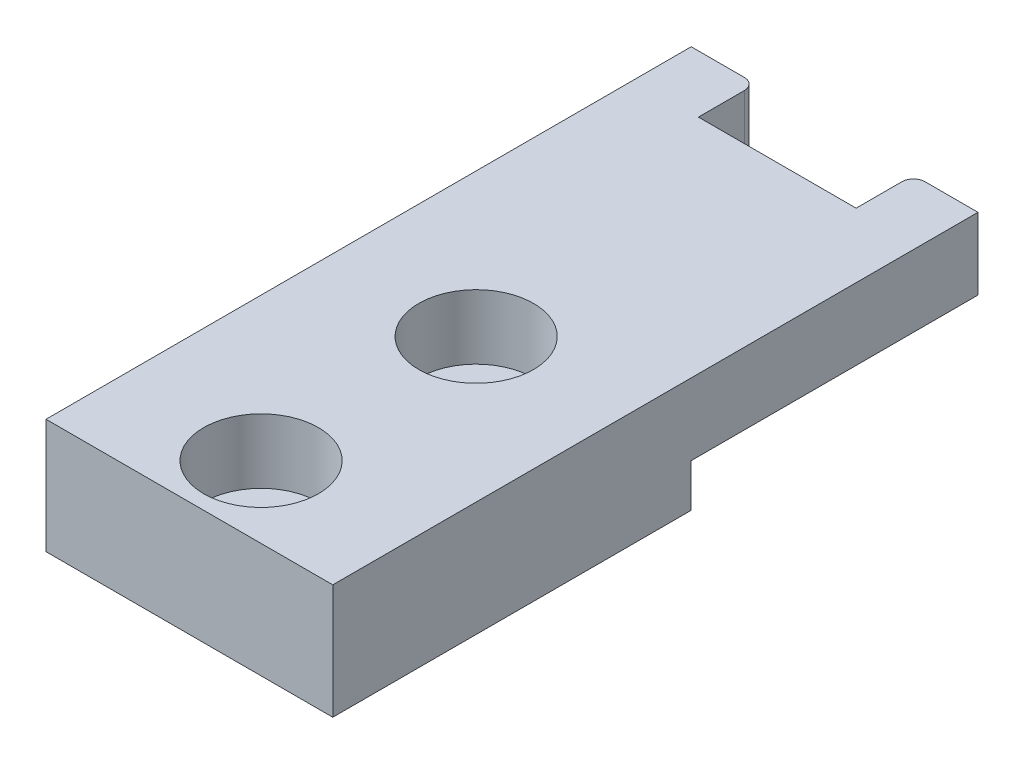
from build123d import *

# Parameters (mm, degrees)
SKETCH_1_W               = 20
SKETCH_1_H               = 8
EXTRUDE_1_DEPTH          = 45
SKETCH_2_OUTSIDE_W       = 31.978
SKETCH_2_OUTSIDE_H       = 56.978
SKETCH_2_OUTSIDE_R       = 2.25
CUT_EXTRUDE_1_DEPTH      = 45
SKETCH_3_R               = 4
CUT_EXTRUDE_2_DEPTH      = 4.5
CUT_EXTRUDE_3_DEPTH      = 50.889878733
CUT_EXTRUDE_3_DEPTH_BACK = 50.889878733


with BuildPart() as part:
    # Sketch 1 → Extrude 1 (new body)
    with BuildSketch(Plane.XY):
        with Locations((10, 4)):
            Rectangle(SKETCH_1_W, SKETCH_1_H)
    extrude(amount=EXTRUDE_1_DEPTH)

    # Sketch 2 outside → Cut-Extrude 1 (cut)
    # profile 1 of 3: a face of its own
    with BuildSketch(Plane(origin=(0, 8, 0), x_dir=(1, 0, 0), z_dir=(0, 1, 0))):
        with Locations((10, -22.5)):
            Rectangle(SKETCH_2_OUTSIDE_W, SKETCH_2_OUTSIDE_H)
        with BuildLine():
            Line((4.5, -4), (4.5, -0.8))
            ThreePointArc((4.5, -0.8), (4.265685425, -0.234314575), (3.7, 0))
            Line((3.7, 0), (0, 0))
            Line((0, 0), (0, -45))
            Line((0, -45), (20, -45))
            Line((20, -45), (20, 0))
            Line((20, 0), (16.3, 0))
            ThreePointArc((16.3, 0), (15.734314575, -0.234314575), (15.5, -0.8))
            Line((15.5, -0.8), (15.5, -4))
            Line((15.5, -4), (4.5, -4))
        make_face(mode=Mode.SUBTRACT)
    # profile 2 of 3: a face of its own
    with BuildSketch(Plane(origin=(0, 8, 0), x_dir=(1, 0, 0), z_dir=(0, 1, 0))):
        with Locations(Location((10, -25, 0), (0, 0, 270))):
            Circle(SKETCH_2_OUTSIDE_R)
    # profile 3 of 3: a face of its own
    with BuildSketch(Plane(origin=(0, 8, 0), x_dir=(1, 0, 0), z_dir=(0, 1, 0))):
        with Locations(Location((10, -40, 0), (0, 0, 270))):
            Circle(SKETCH_2_OUTSIDE_R)
    extrude(amount=-CUT_EXTRUDE_1_DEPTH, mode=Mode.SUBTRACT)

    # Sketch 3 → Cut-Extrude 2 (cut)
    with BuildSketch(Plane(origin=(0, 8, 0), x_dir=(1, 0, 0), z_dir=(0, 1, 0))):
        with Locations(Location((10, -25, 0), (0, 0, 270))):
            Circle(SKETCH_3_R)
        with Locations(Location((10, -40, 0), (0, 0, 270))):
            Circle(SKETCH_3_R)
    extrude(amount=-CUT_EXTRUDE_2_DEPTH, mode=Mode.SUBTRACT)

    # Sketch 4 → Cut-Extrude 3 (cut, two sides: drawn at the far end of the back side and taken through both)
    with BuildSketch(Plane(origin=(20, 0, 0), x_dir=(0, 0, -1), z_dir=(1, 0, 0)).offset(-CUT_EXTRUDE_3_DEPTH_BACK)):
        Polygon((-20, -100.553851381), (-20, 0), (-20, 3), (0, 3), (100.553851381, 3), (231.594866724, -149.553467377), (111.041015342, -253.107318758), align=None)
    extrude(amount=CUT_EXTRUDE_3_DEPTH + CUT_EXTRUDE_3_DEPTH_BACK, mode=Mode.SUBTRACT)


solid = part.part
